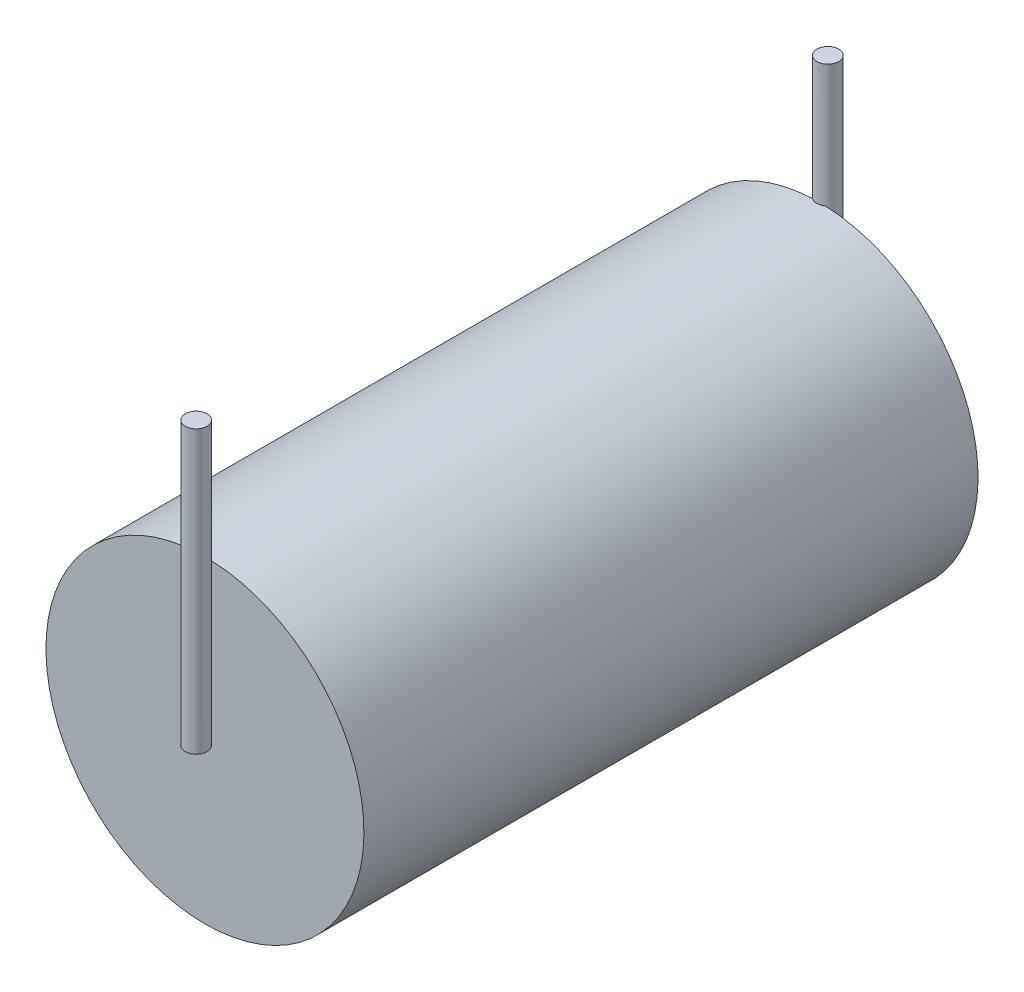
ISO-10303-21;
HEADER;
FILE_DESCRIPTION(('STEP AP214'),'2;1');
FILE_NAME('part.step','',(''),(''),'','','');
FILE_SCHEMA(('AUTOMOTIVE_DESIGN { 1 0 10303 214 1 1 1 1 }'));
ENDSEC;
DATA;
#1=APPLICATION_CONTEXT('core data for automotive mechanical design processes');
#2=APPLICATION_PROTOCOL_DEFINITION('international standard','automotive_design',2000,#1);
#3=PRODUCT_CONTEXT('',#1,'mechanical');
#4=PRODUCT('Part','Part','',(#3));
#5=PRODUCT_RELATED_PRODUCT_CATEGORY('part','',(#4));
#6=PRODUCT_DEFINITION_FORMATION('','',#4);
#7=PRODUCT_DEFINITION_CONTEXT('part definition',#1,'design');
#8=PRODUCT_DEFINITION('design','',#6,#7);
#9=PRODUCT_DEFINITION_SHAPE('','',#8);
#10=(LENGTH_UNIT() NAMED_UNIT(*) SI_UNIT(.MILLI.,.METRE.));
#11=(NAMED_UNIT(*) PLANE_ANGLE_UNIT() SI_UNIT($,.RADIAN.));
#12=(NAMED_UNIT(*) SI_UNIT($,.STERADIAN.) SOLID_ANGLE_UNIT());
#13=UNCERTAINTY_MEASURE_WITH_UNIT(LENGTH_MEASURE(1.E-05),#10,'distance_accuracy_value','');
#14=(GEOMETRIC_REPRESENTATION_CONTEXT(3) GLOBAL_UNCERTAINTY_ASSIGNED_CONTEXT((#13)) GLOBAL_UNIT_ASSIGNED_CONTEXT((#10,
#11,#12)) REPRESENTATION_CONTEXT('',''));
#15=CARTESIAN_POINT('',(0.,0.,0.));
#16=DIRECTION('',(0.,0.,1.));
#17=DIRECTION('',(1.,0.,0.));
#18=AXIS2_PLACEMENT_3D('',#15,#16,#17);
#19=CARTESIAN_POINT('',(0.,0.,22.225));
#20=DIRECTION('',(0.,0.,-1.));
#21=DIRECTION('',(-1.,0.,0.));
#22=AXIS2_PLACEMENT_3D('',#19,#20,#21);
#23=CYLINDRICAL_SURFACE('',#22,5.7531);
#24=CARTESIAN_POINT('',(0.,5.7531,-0.7112));
#25=CARTESIAN_POINT('',(-0.0220865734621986,5.7530998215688,-0.711199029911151));
#26=CARTESIAN_POINT('',(-0.0441885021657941,5.75297145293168,-0.70933516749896));
#27=CARTESIAN_POINT('',(-0.0877817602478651,5.75247170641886,-0.70192678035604));
#28=CARTESIAN_POINT('',(-0.109272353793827,5.75210004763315,-0.696378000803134));
#29=CARTESIAN_POINT('',(-0.151005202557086,5.75115575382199,-0.681760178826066));
#30=CARTESIAN_POINT('',(-0.171248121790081,5.75058322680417,-0.672693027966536));
#31=CARTESIAN_POINT('',(-0.209919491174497,5.74930154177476,-0.651298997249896));
#32=CARTESIAN_POINT('',(-0.228348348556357,5.74859241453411,-0.638972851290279));
#33=CARTESIAN_POINT('',(-0.262906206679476,5.74711580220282,-0.611386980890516));
#34=CARTESIAN_POINT('',(-0.279031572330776,5.74634822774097,-0.596122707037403));
#35=CARTESIAN_POINT('',(-0.308493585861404,5.74484199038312,-0.563103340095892));
#36=CARTESIAN_POINT('',(-0.32183011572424,5.74410332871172,-0.545348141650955));
#37=CARTESIAN_POINT('',(-0.345347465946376,5.74273751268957,-0.50782985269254));
#38=CARTESIAN_POINT('',(-0.355525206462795,5.74211046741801,-0.488064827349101));
#39=CARTESIAN_POINT('',(-0.37241637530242,5.74103977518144,-0.447101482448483));
#40=CARTESIAN_POINT('',(-0.379129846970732,5.74059612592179,-0.425903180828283));
#41=CARTESIAN_POINT('',(-0.388891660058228,5.73994312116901,-0.38271054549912));
#42=CARTESIAN_POINT('',(-0.391945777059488,5.73973339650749,-0.36071752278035));
#43=CARTESIAN_POINT('',(-0.394320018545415,5.739570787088,-0.316530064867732));
#44=CARTESIAN_POINT('',(-0.393640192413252,5.73961789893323,-0.2943356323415));
#45=CARTESIAN_POINT('',(-0.388570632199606,5.73996330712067,-0.250414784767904));
#46=CARTESIAN_POINT('',(-0.384187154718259,5.74026117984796,-0.228687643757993));
#47=CARTESIAN_POINT('',(-0.371844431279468,5.74107387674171,-0.186278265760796));
#48=CARTESIAN_POINT('',(-0.363885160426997,5.74158870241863,-0.1655960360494));
#49=CARTESIAN_POINT('',(-0.344609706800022,5.7427777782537,-0.125843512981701));
#50=CARTESIAN_POINT('',(-0.33329069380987,5.74345216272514,-0.106774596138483));
#51=CARTESIAN_POINT('',(-0.307619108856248,5.74488422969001,-0.0708050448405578));
#52=CARTESIAN_POINT('',(-0.29326649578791,5.74564191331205,-0.0539044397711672));
#53=CARTESIAN_POINT('',(-0.26189992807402,5.74715707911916,-0.0227148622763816));
#54=CARTESIAN_POINT('',(-0.244880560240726,5.74791455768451,-0.00843133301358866));
#55=CARTESIAN_POINT('',(-0.208682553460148,5.74934246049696,0.0170766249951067));
#56=CARTESIAN_POINT('',(-0.189503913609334,5.75001288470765,0.0283010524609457));
#57=CARTESIAN_POINT('',(-0.149528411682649,5.75119120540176,0.0473717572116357));
#58=CARTESIAN_POINT('',(-0.128731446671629,5.75169909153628,0.0552178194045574));
#59=CARTESIAN_POINT('',(-0.0861111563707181,5.75249497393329,0.0673053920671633));
#60=CARTESIAN_POINT('',(-0.0642878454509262,5.75278297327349,0.0715469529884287));
#61=CARTESIAN_POINT('',(-0.0202815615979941,5.75310623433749,0.0762983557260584));
#62=CARTESIAN_POINT('',(0.00190059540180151,5.75314200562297,0.0768157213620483));
#63=CARTESIAN_POINT('',(0.0460364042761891,5.75295813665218,0.0741237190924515));
#64=CARTESIAN_POINT('',(0.0679900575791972,5.75273849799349,0.0709143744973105));
#65=CARTESIAN_POINT('',(0.111024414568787,5.75206885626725,0.060866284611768));
#66=CARTESIAN_POINT('',(0.132105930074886,5.75161907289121,0.0540310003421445));
#67=CARTESIAN_POINT('',(0.172822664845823,5.75053972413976,0.0369285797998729));
#68=CARTESIAN_POINT('',(0.192457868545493,5.74991015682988,0.0266614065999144));
#69=CARTESIAN_POINT('',(0.229759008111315,5.7485406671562,0.00296756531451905));
#70=CARTESIAN_POINT('',(0.247421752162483,5.74780057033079,-0.0104641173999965));
#71=CARTESIAN_POINT('',(0.280244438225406,5.74629386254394,-0.0400984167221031));
#72=CARTESIAN_POINT('',(0.295404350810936,5.74552725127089,-0.0563010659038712));
#73=CARTESIAN_POINT('',(0.322816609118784,5.74405243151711,-0.0910498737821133));
#74=CARTESIAN_POINT('',(0.335064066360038,5.74334432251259,-0.109599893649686));
#75=CARTESIAN_POINT('',(0.356270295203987,5.74206795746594,-0.148497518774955));
#76=CARTESIAN_POINT('',(0.365229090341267,5.74149970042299,-0.168845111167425));
#77=CARTESIAN_POINT('',(0.379595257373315,5.74056784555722,-0.210742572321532));
#78=CARTESIAN_POINT('',(0.385005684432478,5.74020407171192,-0.232291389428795));
#79=CARTESIAN_POINT('',(0.392131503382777,5.7397217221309,-0.275994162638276));
#80=CARTESIAN_POINT('',(0.393846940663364,5.7396031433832,-0.298148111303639));
#81=CARTESIAN_POINT('',(0.393533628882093,5.73962463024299,-0.342383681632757));
#82=CARTESIAN_POINT('',(0.391512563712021,5.73976416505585,-0.364465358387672));
#83=CARTESIAN_POINT('',(0.383799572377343,5.74028503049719,-0.407974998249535));
#84=CARTESIAN_POINT('',(0.37810763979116,5.74066636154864,-0.429402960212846));
#85=CARTESIAN_POINT('',(0.363216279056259,5.74162771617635,-0.470997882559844));
#86=CARTESIAN_POINT('',(0.354016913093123,5.74220773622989,-0.491164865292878));
#87=CARTESIAN_POINT('',(0.332372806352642,5.74350110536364,-0.529669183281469));
#88=CARTESIAN_POINT('',(0.319928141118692,5.74421445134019,-0.548006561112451));
#89=CARTESIAN_POINT('',(0.292118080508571,5.74569581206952,-0.582370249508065));
#90=CARTESIAN_POINT('',(0.276747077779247,5.74646392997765,-0.598392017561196));
#91=CARTESIAN_POINT('',(0.243529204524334,5.74796737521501,-0.62763365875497));
#92=CARTESIAN_POINT('',(0.225681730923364,5.74870269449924,-0.64085284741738));
#93=CARTESIAN_POINT('',(0.187993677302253,5.75005859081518,-0.664125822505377));
#94=CARTESIAN_POINT('',(0.168150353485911,5.75067900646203,-0.674175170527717));
#95=CARTESIAN_POINT('',(0.127068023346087,5.75173311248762,-0.690787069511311));
#96=CARTESIAN_POINT('',(0.105830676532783,5.75216702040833,-0.697353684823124));
#97=CARTESIAN_POINT('',(0.0703871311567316,5.75268610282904,-0.705115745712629));
#98=CARTESIAN_POINT('',(0.0564097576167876,5.75284062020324,-0.707394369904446));
#99=CARTESIAN_POINT('',(0.0282903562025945,5.75304762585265,-0.710436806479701));
#100=CARTESIAN_POINT('',(0.0141483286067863,5.75310011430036,-0.711200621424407));
#101=CARTESIAN_POINT('',(0.,5.7531,-0.7112));
#102=B_SPLINE_CURVE_WITH_KNOTS('',3,(#24,#25,#26,#27,#28,#29,#30,#31,#32,#33,#34,#35,#36,#37,
#38,#39,#40,#41,#42,#43,#44,#45,#46,#47,#48,#49,#50,#51,#52,#53,#54,#55,#56,#57,#58,#59,#60,#61,
#62,#63,#64,#65,#66,#67,#68,#69,#70,#71,#72,#73,#74,#75,#76,#77,#78,#79,#80,#81,#82,#83,#84,#85,
#86,#87,#88,#89,#90,#91,#92,#93,#94,#95,#96,#97,#98,#99,#100,#101),.UNSPECIFIED.,.T.,.F.,(4,2,2,
2,2,2,2,2,2,2,2,2,2,2,2,2,2,2,2,2,2,2,2,2,2,2,2,2,2,2,2,2,2,2,2,2,2,2,4),(0.,0.0662080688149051,
0.1324927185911,0.198741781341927,0.264975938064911,0.331313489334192,0.3976538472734,
0.464058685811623,0.530462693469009,0.596761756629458,0.663059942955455,0.729246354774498,
0.795433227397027,0.861676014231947,0.927919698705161,0.994299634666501,1.0606795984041,
1.12706378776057,1.19344704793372,1.25969615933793,1.32594485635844,1.39213043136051,
1.45831671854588,1.52460860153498,1.59090126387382,1.65730442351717,1.72370710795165,
1.79005254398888,1.85639716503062,1.92260550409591,1.9888139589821,2.05502124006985,
2.12122698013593,2.1875608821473,2.2539109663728,2.32035354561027,2.38671841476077,
2.42913038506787,2.47154228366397),.UNSPECIFIED.);
#103=CARTESIAN_POINT('',(-0.232794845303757,5.74838813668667,0.));
#104=VERTEX_POINT('',#103);
#105=CARTESIAN_POINT('',(0.232794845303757,5.74838813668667,0.));
#106=VERTEX_POINT('',#105);
#107=EDGE_CURVE('E112',#104,#106,#102,.T.);
#108=ORIENTED_EDGE('',*,*,#107,.F.);
#109=CARTESIAN_POINT('',(0.,0.,0.));
#110=DIRECTION('',(0.,0.,1.));
#111=DIRECTION('',(1.,0.,0.));
#112=AXIS2_PLACEMENT_3D('',#109,#110,#111);
#113=CIRCLE('',#112,5.7531);
#114=EDGE_CURVE('E117',#104,#106,#113,.T.);
#115=ORIENTED_EDGE('',*,*,#114,.T.);
#116=EDGE_LOOP('',(#108,#115));
#117=FACE_BOUND('',#116,.T.);
#118=CARTESIAN_POINT('',(0.,5.7531,22.1488));
#119=CARTESIAN_POINT('',(-0.0220865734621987,5.7530998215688,22.1488009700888));
#120=CARTESIAN_POINT('',(-0.0441885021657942,5.75297145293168,22.150664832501));
#121=CARTESIAN_POINT('',(-0.0877817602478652,5.75247170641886,22.158073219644));
#122=CARTESIAN_POINT('',(-0.109272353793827,5.75210004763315,22.1636219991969));
#123=CARTESIAN_POINT('',(-0.151005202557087,5.75115575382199,22.1782398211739));
#124=CARTESIAN_POINT('',(-0.171248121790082,5.75058322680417,22.1873069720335));
#125=CARTESIAN_POINT('',(-0.209919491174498,5.74930154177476,22.2087010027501));
#126=CARTESIAN_POINT('',(-0.228348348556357,5.74859241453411,22.2210271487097));
#127=CARTESIAN_POINT('',(-0.262906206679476,5.74711580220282,22.2486130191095));
#128=CARTESIAN_POINT('',(-0.279031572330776,5.74634822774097,22.2638772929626));
#129=CARTESIAN_POINT('',(-0.308493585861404,5.74484199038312,22.2968966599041));
#130=CARTESIAN_POINT('',(-0.32183011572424,5.74410332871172,22.314651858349));
#131=CARTESIAN_POINT('',(-0.345347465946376,5.74273751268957,22.3521701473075));
#132=CARTESIAN_POINT('',(-0.355525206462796,5.74211046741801,22.3719351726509));
#133=CARTESIAN_POINT('',(-0.37241637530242,5.74103977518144,22.4128985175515));
#134=CARTESIAN_POINT('',(-0.379129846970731,5.74059612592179,22.4340968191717));
#135=CARTESIAN_POINT('',(-0.388891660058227,5.73994312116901,22.4772894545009));
#136=CARTESIAN_POINT('',(-0.391945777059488,5.73973339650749,22.4992824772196));
#137=CARTESIAN_POINT('',(-0.394320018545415,5.739570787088,22.5434699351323));
#138=CARTESIAN_POINT('',(-0.393640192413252,5.73961789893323,22.5656643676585));
#139=CARTESIAN_POINT('',(-0.388570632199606,5.73996330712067,22.6095852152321));
#140=CARTESIAN_POINT('',(-0.384187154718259,5.74026117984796,22.631312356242));
#141=CARTESIAN_POINT('',(-0.371844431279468,5.74107387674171,22.6737217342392));
#142=CARTESIAN_POINT('',(-0.363885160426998,5.74158870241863,22.6944039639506));
#143=CARTESIAN_POINT('',(-0.344609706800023,5.7427777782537,22.7341564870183));
#144=CARTESIAN_POINT('',(-0.33329069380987,5.74345216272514,22.7532254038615));
#145=CARTESIAN_POINT('',(-0.307619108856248,5.74488422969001,22.7891949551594));
#146=CARTESIAN_POINT('',(-0.29326649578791,5.74564191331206,22.8060955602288));
#147=CARTESIAN_POINT('',(-0.261899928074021,5.74715707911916,22.8372851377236));
#148=CARTESIAN_POINT('',(-0.244880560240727,5.74791455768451,22.8515686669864));
#149=CARTESIAN_POINT('',(-0.208682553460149,5.74934246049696,22.8770766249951));
#150=CARTESIAN_POINT('',(-0.189503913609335,5.75001288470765,22.8883010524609));
#151=CARTESIAN_POINT('',(-0.149528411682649,5.75119120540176,22.9073717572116));
#152=CARTESIAN_POINT('',(-0.128731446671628,5.75169909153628,22.9152178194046));
#153=CARTESIAN_POINT('',(-0.0861111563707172,5.75249497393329,22.9273053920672));
#154=CARTESIAN_POINT('',(-0.0642878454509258,5.75278297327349,22.9315469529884));
#155=CARTESIAN_POINT('',(-0.0202815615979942,5.75310623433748,22.9362983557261));
#156=CARTESIAN_POINT('',(0.00190059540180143,5.75314200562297,22.936815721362));
#157=CARTESIAN_POINT('',(0.0460364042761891,5.75295813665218,22.9341237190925));
#158=CARTESIAN_POINT('',(0.0679900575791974,5.75273849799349,22.9309143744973));
#159=CARTESIAN_POINT('',(0.111024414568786,5.75206885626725,22.9208662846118));
#160=CARTESIAN_POINT('',(0.132105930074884,5.75161907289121,22.9140310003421));
#161=CARTESIAN_POINT('',(0.172822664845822,5.75053972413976,22.8969285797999));
#162=CARTESIAN_POINT('',(0.192457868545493,5.74991015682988,22.8866614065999));
#163=CARTESIAN_POINT('',(0.229759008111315,5.7485406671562,22.8629675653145));
#164=CARTESIAN_POINT('',(0.247421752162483,5.74780057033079,22.8495358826));
#165=CARTESIAN_POINT('',(0.280244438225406,5.74629386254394,22.8199015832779));
#166=CARTESIAN_POINT('',(0.295404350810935,5.74552725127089,22.8036989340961));
#167=CARTESIAN_POINT('',(0.322816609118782,5.74405243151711,22.7689501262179));
#168=CARTESIAN_POINT('',(0.335064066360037,5.74334432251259,22.7504001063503));
#169=CARTESIAN_POINT('',(0.356270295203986,5.74206795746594,22.711502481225));
#170=CARTESIAN_POINT('',(0.365229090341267,5.74149970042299,22.6911548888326));
#171=CARTESIAN_POINT('',(0.379595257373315,5.74056784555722,22.6492574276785));
#172=CARTESIAN_POINT('',(0.385005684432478,5.74020407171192,22.6277086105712));
#173=CARTESIAN_POINT('',(0.392131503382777,5.7397217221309,22.5840058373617));
#174=CARTESIAN_POINT('',(0.393846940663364,5.7396031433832,22.5618518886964));
#175=CARTESIAN_POINT('',(0.393533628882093,5.73962463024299,22.5176163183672));
#176=CARTESIAN_POINT('',(0.39151256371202,5.73976416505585,22.4955346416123));
#177=CARTESIAN_POINT('',(0.383799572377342,5.74028503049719,22.4520250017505));
#178=CARTESIAN_POINT('',(0.378107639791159,5.74066636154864,22.4305970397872));
#179=CARTESIAN_POINT('',(0.363216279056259,5.74162771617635,22.3890021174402));
#180=CARTESIAN_POINT('',(0.354016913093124,5.74220773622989,22.3688351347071));
#181=CARTESIAN_POINT('',(0.332372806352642,5.74350110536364,22.3303308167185));
#182=CARTESIAN_POINT('',(0.319928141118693,5.74421445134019,22.3119934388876));
#183=CARTESIAN_POINT('',(0.292118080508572,5.74569581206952,22.2776297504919));
#184=CARTESIAN_POINT('',(0.276747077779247,5.74646392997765,22.2616079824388));
#185=CARTESIAN_POINT('',(0.243529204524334,5.74796737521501,22.232366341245));
#186=CARTESIAN_POINT('',(0.225681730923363,5.74870269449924,22.2191471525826));
#187=CARTESIAN_POINT('',(0.187993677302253,5.75005859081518,22.1958741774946));
#188=CARTESIAN_POINT('',(0.16815035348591,5.75067900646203,22.1858248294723));
#189=CARTESIAN_POINT('',(0.127068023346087,5.75173311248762,22.1692129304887));
#190=CARTESIAN_POINT('',(0.105830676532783,5.75216702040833,22.1626463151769));
#191=CARTESIAN_POINT('',(0.0703871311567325,5.75268610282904,22.1548842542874));
#192=CARTESIAN_POINT('',(0.0564097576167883,5.75284062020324,22.1526056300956));
#193=CARTESIAN_POINT('',(0.028290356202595,5.75304762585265,22.1495631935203));
#194=CARTESIAN_POINT('',(0.0141483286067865,5.75310011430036,22.1487993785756));
#195=CARTESIAN_POINT('',(0.,5.7531,22.1488));
#196=B_SPLINE_CURVE_WITH_KNOTS('',3,(#118,#119,#120,#121,#122,#123,#124,#125,#126,#127,#128,
#129,#130,#131,#132,#133,#134,#135,#136,#137,#138,#139,#140,#141,#142,#143,#144,#145,#146,#147,
#148,#149,#150,#151,#152,#153,#154,#155,#156,#157,#158,#159,#160,#161,#162,#163,#164,#165,#166,
#167,#168,#169,#170,#171,#172,#173,#174,#175,#176,#177,#178,#179,#180,#181,#182,#183,#184,#185,
#186,#187,#188,#189,#190,#191,#192,#193,#194,#195),.UNSPECIFIED.,.T.,.F.,(4,2,2,2,2,2,2,2,2,2,2,
2,2,2,2,2,2,2,2,2,2,2,2,2,2,2,2,2,2,2,2,2,2,2,2,2,2,2,4),(0.,0.0662080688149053,0.1324927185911,
0.198741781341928,0.264975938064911,0.33131348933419,0.397653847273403,0.464058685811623,
0.530462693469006,0.596761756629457,0.663059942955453,0.729246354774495,0.795433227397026,
0.861676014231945,0.927919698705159,0.994299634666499,1.0606795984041,1.12706378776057,
1.19344704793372,1.25969615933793,1.32594485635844,1.39213043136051,1.45831671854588,
1.52460860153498,1.59090126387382,1.65730442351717,1.72370710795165,1.79005254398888,
1.85639716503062,1.92260550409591,1.9888139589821,2.05502124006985,2.12122698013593,
2.18756088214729,2.2539109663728,2.32035354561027,2.38671841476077,2.42913038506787,
2.47154228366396),.UNSPECIFIED.);
#197=CARTESIAN_POINT('',(0.232794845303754,5.74838813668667,22.225));
#198=VERTEX_POINT('',#197);
#199=CARTESIAN_POINT('',(-0.232794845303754,5.74838813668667,22.225));
#200=VERTEX_POINT('',#199);
#201=EDGE_CURVE('E82',#198,#200,#196,.T.);
#202=ORIENTED_EDGE('',*,*,#201,.F.);
#203=CARTESIAN_POINT('',(0.,0.,22.225));
#204=DIRECTION('',(0.,0.,1.));
#205=DIRECTION('',(1.,0.,0.));
#206=AXIS2_PLACEMENT_3D('',#203,#204,#205);
#207=CIRCLE('',#206,5.7531);
#208=EDGE_CURVE('E67',#200,#198,#207,.T.);
#209=ORIENTED_EDGE('',*,*,#208,.F.);
#210=EDGE_LOOP('',(#202,#209));
#211=FACE_BOUND('',#210,.T.);
#212=ADVANCED_FACE('F30',(#117,#211),#23,.T.);
#213=CARTESIAN_POINT('',(0.,0.,22.225));
#214=DIRECTION('',(0.,0.,1.));
#215=DIRECTION('',(1.,0.,0.));
#216=AXIS2_PLACEMENT_3D('',#213,#214,#215);
#217=PLANE('',#216);
#218=DIRECTION('',(1.,0.,0.));
#219=VECTOR('',#218,1.);
#220=CARTESIAN_POINT('',(0.,0.,22.225));
#221=LINE('',#220,#219);
#222=CARTESIAN_POINT('',(-0.232794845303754,0.,22.225));
#223=VERTEX_POINT('',#222);
#224=CARTESIAN_POINT('',(0.232794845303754,0.,22.225));
#225=VERTEX_POINT('',#224);
#226=EDGE_CURVE('E44',#223,#225,#221,.T.);
#227=ORIENTED_EDGE('',*,*,#226,.F.);
#228=DIRECTION('',(0.,-1.,0.));
#229=VECTOR('',#228,1.);
#230=CARTESIAN_POINT('',(-0.232794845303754,10.1981,22.225));
#231=LINE('',#230,#229);
#232=EDGE_CURVE('E11',#223,#200,#231,.F.);
#233=ORIENTED_EDGE('',*,*,#232,.T.);
#234=ORIENTED_EDGE('',*,*,#208,.T.);
#235=DIRECTION('',(0.,-1.,0.));
#236=VECTOR('',#235,1.);
#237=CARTESIAN_POINT('',(0.232794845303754,10.1981,22.225));
#238=LINE('',#237,#236);
#239=EDGE_CURVE('E38',#198,#225,#238,.T.);
#240=ORIENTED_EDGE('',*,*,#239,.T.);
#241=EDGE_LOOP('',(#227,#233,#234,#240));
#242=FACE_BOUND('',#241,.T.);
#243=ADVANCED_FACE('F66',(#242),#217,.T.);
#244=CARTESIAN_POINT('',(0.,0.,0.));
#245=DIRECTION('',(0.,0.,1.));
#246=DIRECTION('',(1.,0.,0.));
#247=AXIS2_PLACEMENT_3D('',#244,#245,#246);
#248=PLANE('',#247);
#249=DIRECTION('',(0.,-1.,0.));
#250=VECTOR('',#249,1.);
#251=CARTESIAN_POINT('',(-0.232794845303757,10.1981,0.));
#252=LINE('',#251,#250);
#253=CARTESIAN_POINT('',(-0.232794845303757,0.,0.));
#254=VERTEX_POINT('',#253);
#255=EDGE_CURVE('E75',#254,#104,#252,.F.);
#256=ORIENTED_EDGE('',*,*,#255,.F.);
#257=DIRECTION('',(-1.,0.,0.));
#258=VECTOR('',#257,1.);
#259=CARTESIAN_POINT('',(0.,0.,0.));
#260=LINE('',#259,#258);
#261=CARTESIAN_POINT('',(0.232794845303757,0.,0.));
#262=VERTEX_POINT('',#261);
#263=EDGE_CURVE('E122',#262,#254,#260,.T.);
#264=ORIENTED_EDGE('',*,*,#263,.F.);
#265=DIRECTION('',(0.,-1.,0.));
#266=VECTOR('',#265,1.);
#267=CARTESIAN_POINT('',(0.232794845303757,10.1981,0.));
#268=LINE('',#267,#266);
#269=EDGE_CURVE('E125',#106,#262,#268,.T.);
#270=ORIENTED_EDGE('',*,*,#269,.F.);
#271=ORIENTED_EDGE('',*,*,#114,.F.);
#272=EDGE_LOOP('',(#256,#264,#270,#271));
#273=FACE_BOUND('',#272,.T.);
#274=ADVANCED_FACE('F109',(#273),#248,.F.);
#275=CARTESIAN_POINT('',(0.,10.1981,-0.3175));
#276=DIRECTION('',(0.,-1.,0.));
#277=DIRECTION('',(0.,0.,-1.));
#278=AXIS2_PLACEMENT_3D('',#275,#276,#277);
#279=CYLINDRICAL_SURFACE('',#278,0.3937);
#280=CARTESIAN_POINT('',(0.,10.1981,-0.3175));
#281=DIRECTION('',(0.,1.,0.));
#282=DIRECTION('',(0.,0.,1.));
#283=AXIS2_PLACEMENT_3D('',#280,#281,#282);
#284=CIRCLE('',#283,0.3937);
#285=CARTESIAN_POINT('',(0.,10.1981,0.0761999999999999));
#286=VERTEX_POINT('',#285);
#287=EDGE_CURVE('E118',#286,#286,#284,.T.);
#288=ORIENTED_EDGE('',*,*,#287,.F.);
#289=EDGE_LOOP('',(#288));
#290=FACE_BOUND('',#289,.T.);
#291=CARTESIAN_POINT('',(0.,0.,-0.3175));
#292=DIRECTION('',(0.,1.,0.));
#293=DIRECTION('',(0.,0.,1.));
#294=AXIS2_PLACEMENT_3D('',#291,#292,#293);
#295=CIRCLE('',#294,0.3937);
#296=EDGE_CURVE('E89',#262,#254,#295,.T.);
#297=ORIENTED_EDGE('',*,*,#296,.T.);
#298=ORIENTED_EDGE('',*,*,#255,.T.);
#299=ORIENTED_EDGE('',*,*,#107,.T.);
#300=ORIENTED_EDGE('',*,*,#269,.T.);
#301=EDGE_LOOP('',(#297,#298,#299,#300));
#302=FACE_BOUND('',#301,.T.);
#303=ADVANCED_FACE('F101',(#290,#302),#279,.T.);
#304=CARTESIAN_POINT('',(0.,0.,-0.3175));
#305=DIRECTION('',(0.,1.,0.));
#306=DIRECTION('',(0.,0.,1.));
#307=AXIS2_PLACEMENT_3D('',#304,#305,#306);
#308=PLANE('',#307);
#309=ORIENTED_EDGE('',*,*,#296,.F.);
#310=ORIENTED_EDGE('',*,*,#263,.T.);
#311=EDGE_LOOP('',(#309,#310));
#312=FACE_BOUND('',#311,.T.);
#313=ADVANCED_FACE('F98',(#312),#308,.F.);
#314=CARTESIAN_POINT('',(0.,10.1981,-0.3175));
#315=DIRECTION('',(0.,1.,0.));
#316=DIRECTION('',(0.,0.,1.));
#317=AXIS2_PLACEMENT_3D('',#314,#315,#316);
#318=PLANE('',#317);
#319=ORIENTED_EDGE('',*,*,#287,.T.);
#320=EDGE_LOOP('',(#319));
#321=FACE_BOUND('',#320,.T.);
#322=ADVANCED_FACE('F96',(#321),#318,.T.);
#323=CARTESIAN_POINT('',(0.,10.1981,22.5425));
#324=DIRECTION('',(0.,-1.,0.));
#325=DIRECTION('',(0.,0.,-1.));
#326=AXIS2_PLACEMENT_3D('',#323,#324,#325);
#327=CYLINDRICAL_SURFACE('',#326,0.3937);
#328=ORIENTED_EDGE('',*,*,#232,.F.);
#329=CARTESIAN_POINT('',(0.,0.,22.5425));
#330=DIRECTION('',(0.,1.,0.));
#331=DIRECTION('',(0.,0.,-1.));
#332=AXIS2_PLACEMENT_3D('',#329,#330,#331);
#333=CIRCLE('',#332,0.3937);
#334=EDGE_CURVE('E74',#223,#225,#333,.T.);
#335=ORIENTED_EDGE('',*,*,#334,.T.);
#336=ORIENTED_EDGE('',*,*,#239,.F.);
#337=ORIENTED_EDGE('',*,*,#201,.T.);
#338=EDGE_LOOP('',(#328,#335,#336,#337));
#339=FACE_BOUND('',#338,.T.);
#340=CARTESIAN_POINT('',(0.,10.1981,22.5425));
#341=DIRECTION('',(0.,1.,0.));
#342=DIRECTION('',(0.,0.,-1.));
#343=AXIS2_PLACEMENT_3D('',#340,#341,#342);
#344=CIRCLE('',#343,0.3937);
#345=CARTESIAN_POINT('',(0.,10.1981,22.1488));
#346=VERTEX_POINT('',#345);
#347=EDGE_CURVE('E79',#346,#346,#344,.T.);
#348=ORIENTED_EDGE('',*,*,#347,.F.);
#349=EDGE_LOOP('',(#348));
#350=FACE_BOUND('',#349,.T.);
#351=ADVANCED_FACE('F77',(#339,#350),#327,.T.);
#352=CARTESIAN_POINT('',(0.,10.1981,22.5425));
#353=DIRECTION('',(0.,-1.,0.));
#354=DIRECTION('',(0.,0.,-1.));
#355=AXIS2_PLACEMENT_3D('',#352,#353,#354);
#356=PLANE('',#355);
#357=ORIENTED_EDGE('',*,*,#347,.T.);
#358=EDGE_LOOP('',(#357));
#359=FACE_BOUND('',#358,.T.);
#360=ADVANCED_FACE('F95',(#359),#356,.F.);
#361=CARTESIAN_POINT('',(0.,0.,22.5425));
#362=DIRECTION('',(0.,-1.,0.));
#363=DIRECTION('',(0.,0.,-1.));
#364=AXIS2_PLACEMENT_3D('',#361,#362,#363);
#365=PLANE('',#364);
#366=ORIENTED_EDGE('',*,*,#334,.F.);
#367=ORIENTED_EDGE('',*,*,#226,.T.);
#368=EDGE_LOOP('',(#366,#367));
#369=FACE_BOUND('',#368,.T.);
#370=ADVANCED_FACE('F73',(#369),#365,.T.);
#371=CLOSED_SHELL('',(#212,#243,#274,#303,#313,#322,#351,#360,#370));
#372=MANIFOLD_SOLID_BREP('B2',#371);
#373=ADVANCED_BREP_SHAPE_REPRESENTATION('',(#18,#372),#14);
#374=SHAPE_DEFINITION_REPRESENTATION(#9,#373);
ENDSEC;
END-ISO-10303-21;
